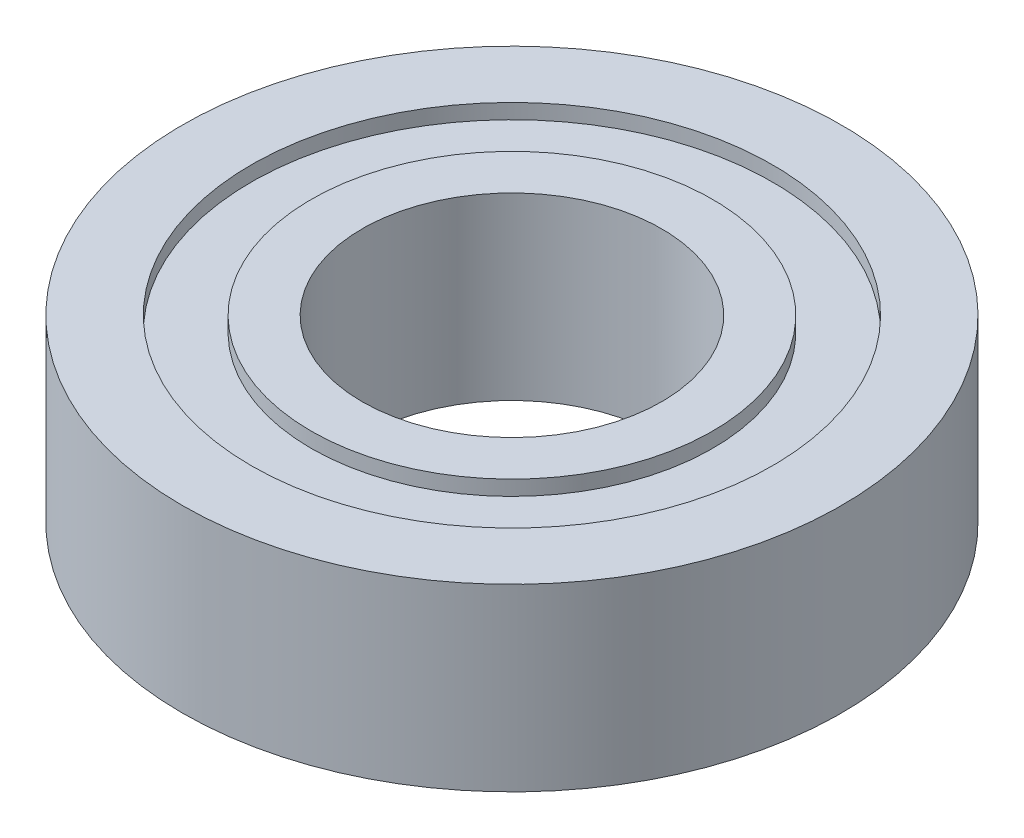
from build123d import *

# Parameters (mm, degrees)
EXTRUDE_1_DEPTH      = 3
EXTRUDE_1_DEPTH_BACK = 3
SKETCH_1_R           = 11
SKETCH_1_R_2         = 5
SKETCH_2_R           = 8.7
SKETCH_2_R_2         = 6.7
CUT_EXTRUDE_1_DEPTH  = 0.5


with BuildPart() as part:
    # Sketch 1 → Extrude 1 (new, two sides: drawn at the far end of the back side and taken through both)
    with BuildSketch(Plane(origin=(0, 0, 0), x_dir=(1, 0, 0), z_dir=(0, 1, 0)).offset(-EXTRUDE_1_DEPTH_BACK)):
        with Locations(Location((0, 0, 0), (0, 0, 270))):
            Circle(SKETCH_1_R)
        with Locations(Location((0, 0, 0), (0, 0, 270))):
            Circle(SKETCH_1_R_2, mode=Mode.SUBTRACT)
    extrude(amount=EXTRUDE_1_DEPTH + EXTRUDE_1_DEPTH_BACK)

    # Sketch 2 → Cut-Extrude 1 (cut)
    with BuildSketch(Plane(origin=(0, 3, 0), x_dir=(1, 0, 0), z_dir=(0, 1, 0))):
        with Locations(Location((0, 0, 0), (0, 0, 270))):
            Circle(SKETCH_2_R)
        with Locations(Location((0, 0, 0), (0, 0, 270))):
            Circle(SKETCH_2_R_2, mode=Mode.SUBTRACT)
    cut_extrude_1 = extrude(amount=-CUT_EXTRUDE_1_DEPTH, mode=Mode.SUBTRACT)

    # Mirror 1: Cut-Extrude 1 across plane
    add(cut_extrude_1.mirror(Plane.ZX), mode=Mode.SUBTRACT)


solid = part.part
